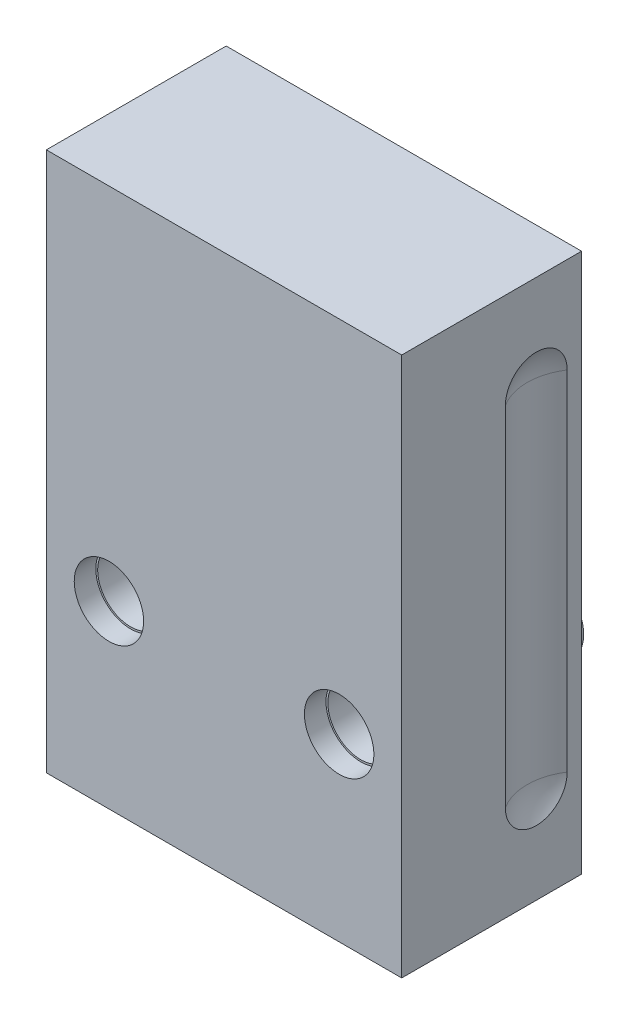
ISO-10303-21;
HEADER;
FILE_DESCRIPTION(('STEP AP214'),'2;1');
FILE_NAME('part.step','',(''),(''),'','','');
FILE_SCHEMA(('AUTOMOTIVE_DESIGN { 1 0 10303 214 1 1 1 1 }'));
ENDSEC;
DATA;
#1=APPLICATION_CONTEXT('core data for automotive mechanical design processes');
#2=APPLICATION_PROTOCOL_DEFINITION('international standard','automotive_design',2000,#1);
#3=PRODUCT_CONTEXT('',#1,'mechanical');
#4=PRODUCT('Part','Part','',(#3));
#5=PRODUCT_RELATED_PRODUCT_CATEGORY('part','',(#4));
#6=PRODUCT_DEFINITION_FORMATION('','',#4);
#7=PRODUCT_DEFINITION_CONTEXT('part definition',#1,'design');
#8=PRODUCT_DEFINITION('design','',#6,#7);
#9=PRODUCT_DEFINITION_SHAPE('','',#8);
#10=(LENGTH_UNIT() NAMED_UNIT(*) SI_UNIT(.MILLI.,.METRE.));
#11=(NAMED_UNIT(*) PLANE_ANGLE_UNIT() SI_UNIT($,.RADIAN.));
#12=(NAMED_UNIT(*) SI_UNIT($,.STERADIAN.) SOLID_ANGLE_UNIT());
#13=UNCERTAINTY_MEASURE_WITH_UNIT(LENGTH_MEASURE(1.E-05),#10,'distance_accuracy_value','');
#14=(GEOMETRIC_REPRESENTATION_CONTEXT(3) GLOBAL_UNCERTAINTY_ASSIGNED_CONTEXT((#13)) GLOBAL_UNIT_ASSIGNED_CONTEXT((#10,
#11,#12)) REPRESENTATION_CONTEXT('',''));
#15=CARTESIAN_POINT('',(0.,0.,0.));
#16=DIRECTION('',(0.,0.,1.));
#17=DIRECTION('',(1.,0.,0.));
#18=AXIS2_PLACEMENT_3D('',#15,#16,#17);
#19=CARTESIAN_POINT('',(32.0000005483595,-99.5693254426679,16.5000000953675));
#20=DIRECTION('',(4.38690173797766E-08,0.,1.));
#21=DIRECTION('',(1.,0.,-4.38690173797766E-08));
#22=AXIS2_PLACEMENT_3D('',#19,#20,#21);
#23=CYLINDRICAL_SURFACE('',#22,2.6);
#24=CARTESIAN_POINT('',(31.9999999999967,-99.5693254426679,3.9999998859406));
#25=DIRECTION('',(0.,0.,-1.));
#26=DIRECTION('',(-1.,0.,0.));
#27=AXIS2_PLACEMENT_3D('',#24,#25,#26);
#28=CIRCLE('',#27,2.6);
#29=CARTESIAN_POINT('',(29.3999999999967,-99.5693254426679,3.9999998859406));
#30=VERTEX_POINT('',#29);
#31=EDGE_CURVE('E142',#30,#30,#28,.T.);
#32=ORIENTED_EDGE('',*,*,#31,.T.);
#33=EDGE_LOOP('',(#32));
#34=FACE_BOUND('',#33,.T.);
#35=CARTESIAN_POINT('',(32.0000001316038,-99.5693254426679,7.00000030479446));
#36=DIRECTION('',(4.38690173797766E-08,0.,1.));
#37=DIRECTION('',(1.,0.,-4.38690173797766E-08));
#38=AXIS2_PLACEMENT_3D('',#35,#36,#37);
#39=CIRCLE('',#38,2.6);
#40=CARTESIAN_POINT('',(34.6000001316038,-99.5693254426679,7.00000019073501));
#41=VERTEX_POINT('',#40);
#42=EDGE_CURVE('E18',#41,#41,#39,.T.);
#43=ORIENTED_EDGE('',*,*,#42,.T.);
#44=EDGE_LOOP('',(#43));
#45=FACE_BOUND('',#44,.T.);
#46=ADVANCED_FACE('F14',(#34,#45),#23,.F.);
#47=CARTESIAN_POINT('',(5.48359695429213E-07,-99.5693254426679,16.5000000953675));
#48=DIRECTION('',(4.38690173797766E-08,0.,1.));
#49=DIRECTION('',(1.,0.,-4.38690173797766E-08));
#50=AXIS2_PLACEMENT_3D('',#47,#48,#49);
#51=CYLINDRICAL_SURFACE('',#50,2.6);
#52=CARTESIAN_POINT('',(1.31604029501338E-07,-99.5693254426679,7.00000007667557));
#53=DIRECTION('',(4.38690173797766E-08,0.,1.));
#54=DIRECTION('',(1.,0.,-4.38690173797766E-08));
#55=AXIS2_PLACEMENT_3D('',#52,#53,#54);
#56=CIRCLE('',#55,2.6);
#57=CARTESIAN_POINT('',(2.60000013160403,-99.5693254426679,6.99999996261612));
#58=VERTEX_POINT('',#57);
#59=EDGE_CURVE('E340',#58,#58,#56,.T.);
#60=ORIENTED_EDGE('',*,*,#59,.T.);
#61=EDGE_LOOP('',(#60));
#62=FACE_BOUND('',#61,.T.);
#63=CARTESIAN_POINT('',(-2.795985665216E-12,-99.5693254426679,3.9999998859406));
#64=DIRECTION('',(0.,0.,-1.));
#65=DIRECTION('',(-1.,0.,0.));
#66=AXIS2_PLACEMENT_3D('',#63,#64,#65);
#67=CIRCLE('',#66,2.6);
#68=CARTESIAN_POINT('',(-2.6000000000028,-99.5693254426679,3.9999998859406));
#69=VERTEX_POINT('',#68);
#70=EDGE_CURVE('E139',#69,#69,#67,.T.);
#71=ORIENTED_EDGE('',*,*,#70,.T.);
#72=EDGE_LOOP('',(#71));
#73=FACE_BOUND('',#72,.T.);
#74=ADVANCED_FACE('F617',(#62,#73),#51,.F.);
#75=CARTESIAN_POINT('',(31.9999999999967,-99.5693254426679,1.50000000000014));
#76=DIRECTION('',(0.,0.,-1.));
#77=DIRECTION('',(-1.,0.,0.));
#78=AXIS2_PLACEMENT_3D('',#75,#76,#77);
#79=CYLINDRICAL_SURFACE('',#78,2.6);
#80=ORIENTED_EDGE('',*,*,#31,.F.);
#81=EDGE_LOOP('',(#80));
#82=FACE_BOUND('',#81,.T.);
#83=CARTESIAN_POINT('',(31.9999999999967,-99.5693254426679,3.02058725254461E-13));
#84=DIRECTION('',(0.,0.,-1.));
#85=DIRECTION('',(-1.,0.,0.));
#86=AXIS2_PLACEMENT_3D('',#83,#84,#85);
#87=CIRCLE('',#86,2.6);
#88=CARTESIAN_POINT('',(29.3999999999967,-99.5693254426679,3.02058725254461E-13));
#89=VERTEX_POINT('',#88);
#90=EDGE_CURVE('E338',#89,#89,#87,.F.);
#91=ORIENTED_EDGE('',*,*,#90,.F.);
#92=EDGE_LOOP('',(#91));
#93=FACE_BOUND('',#92,.T.);
#94=ADVANCED_FACE('F362',(#82,#93),#79,.F.);
#95=CARTESIAN_POINT('',(-2.795985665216E-12,-99.5693254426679,-0.349982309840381));
#96=DIRECTION('',(0.,0.,-1.));
#97=DIRECTION('',(-1.,0.,0.));
#98=AXIS2_PLACEMENT_3D('',#95,#96,#97);
#99=CYLINDRICAL_SURFACE('',#98,2.6);
#100=ORIENTED_EDGE('',*,*,#70,.F.);
#101=EDGE_LOOP('',(#100));
#102=FACE_BOUND('',#101,.T.);
#103=CARTESIAN_POINT('',(-2.795985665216E-12,-99.5693254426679,3.02004515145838E-13));
#104=DIRECTION('',(0.,0.,-1.));
#105=DIRECTION('',(-1.,0.,0.));
#106=AXIS2_PLACEMENT_3D('',#103,#104,#105);
#107=CIRCLE('',#106,2.6);
#108=CARTESIAN_POINT('',(-2.6000000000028,-99.5693254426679,3.02004515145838E-13));
#109=VERTEX_POINT('',#108);
#110=EDGE_CURVE('E335',#109,#109,#107,.F.);
#111=ORIENTED_EDGE('',*,*,#110,.F.);
#112=EDGE_LOOP('',(#111));
#113=FACE_BOUND('',#112,.T.);
#114=ADVANCED_FACE('F351',(#102,#113),#99,.F.);
#115=CARTESIAN_POINT('',(32.0000010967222,-99.5693254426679,7.00000019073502));
#116=DIRECTION('',(0.,0.,-1.));
#117=DIRECTION('',(-1.,0.,0.));
#118=AXIS2_PLACEMENT_3D('',#115,#116,#117);
#119=PLANE('',#118);
#120=CARTESIAN_POINT('',(32.0000010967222,-99.5693254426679,7.00000019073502));
#121=DIRECTION('',(0.,0.,-1.));
#122=DIRECTION('',(-1.,0.,0.));
#123=AXIS2_PLACEMENT_3D('',#120,#121,#122);
#124=CIRCLE('',#123,4.57);
#125=CARTESIAN_POINT('',(27.4300010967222,-99.5693254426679,7.00000019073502));
#126=VERTEX_POINT('',#125);
#127=EDGE_CURVE('E332',#126,#126,#124,.F.);
#128=ORIENTED_EDGE('',*,*,#127,.T.);
#129=EDGE_LOOP('',(#128));
#130=FACE_BOUND('',#129,.T.);
#131=ORIENTED_EDGE('',*,*,#42,.F.);
#132=EDGE_LOOP('',(#131));
#133=FACE_BOUND('',#132,.T.);
#134=ADVANCED_FACE('F348',(#130,#133),#119,.F.);
#135=CARTESIAN_POINT('',(1.09672241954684E-06,-99.5693254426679,7.00000019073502));
#136=DIRECTION('',(0.,0.,-1.));
#137=DIRECTION('',(-1.,0.,0.));
#138=AXIS2_PLACEMENT_3D('',#135,#136,#137);
#139=PLANE('',#138);
#140=CARTESIAN_POINT('',(1.09672241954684E-06,-99.5693254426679,7.00000019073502));
#141=DIRECTION('',(0.,0.,-1.));
#142=DIRECTION('',(-1.,0.,0.));
#143=AXIS2_PLACEMENT_3D('',#140,#141,#142);
#144=CIRCLE('',#143,4.57);
#145=CARTESIAN_POINT('',(-4.56999890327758,-99.5693254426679,7.00000019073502));
#146=VERTEX_POINT('',#145);
#147=EDGE_CURVE('E329',#146,#146,#144,.F.);
#148=ORIENTED_EDGE('',*,*,#147,.T.);
#149=EDGE_LOOP('',(#148));
#150=FACE_BOUND('',#149,.T.);
#151=ORIENTED_EDGE('',*,*,#59,.F.);
#152=EDGE_LOOP('',(#151));
#153=FACE_BOUND('',#152,.T.);
#154=ADVANCED_FACE('F350',(#150,#153),#139,.F.);
#155=CARTESIAN_POINT('',(31.9999999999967,-99.5693254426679,3.01980662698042E-13));
#156=DIRECTION('',(0.,0.,-1.));
#157=DIRECTION('',(-1.,0.,0.));
#158=AXIS2_PLACEMENT_3D('',#155,#156,#157);
#159=PLANE('',#158);
#160=CARTESIAN_POINT('',(31.9999999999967,-99.5693254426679,3.01841884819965E-13));
#161=DIRECTION('',(0.,0.,-1.));
#162=DIRECTION('',(-1.,0.,0.));
#163=AXIS2_PLACEMENT_3D('',#160,#161,#162);
#164=CIRCLE('',#163,5.);
#165=CARTESIAN_POINT('',(26.9999999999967,-99.5693254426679,3.01841884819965E-13));
#166=VERTEX_POINT('',#165);
#167=EDGE_CURVE('E326',#166,#166,#164,.F.);
#168=ORIENTED_EDGE('',*,*,#167,.F.);
#169=EDGE_LOOP('',(#168));
#170=FACE_BOUND('',#169,.T.);
#171=ORIENTED_EDGE('',*,*,#90,.T.);
#172=EDGE_LOOP('',(#171));
#173=FACE_BOUND('',#172,.T.);
#174=ADVANCED_FACE('F359',(#170,#173),#159,.T.);
#175=CARTESIAN_POINT('',(-2.795985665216E-12,-99.5693254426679,3.01980662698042E-13));
#176=DIRECTION('',(0.,0.,-1.));
#177=DIRECTION('',(-1.,0.,0.));
#178=AXIS2_PLACEMENT_3D('',#175,#176,#177);
#179=PLANE('',#178);
#180=CARTESIAN_POINT('',(-2.795985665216E-12,-99.5693254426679,3.01841884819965E-13));
#181=DIRECTION('',(0.,0.,-1.));
#182=DIRECTION('',(-1.,0.,0.));
#183=AXIS2_PLACEMENT_3D('',#180,#181,#182);
#184=CIRCLE('',#183,5.);
#185=CARTESIAN_POINT('',(-5.0000000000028,-99.5693254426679,3.01841884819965E-13));
#186=VERTEX_POINT('',#185);
#187=EDGE_CURVE('E240',#186,#186,#184,.F.);
#188=ORIENTED_EDGE('',*,*,#187,.F.);
#189=EDGE_LOOP('',(#188));
#190=FACE_BOUND('',#189,.T.);
#191=ORIENTED_EDGE('',*,*,#110,.T.);
#192=EDGE_LOOP('',(#191));
#193=FACE_BOUND('',#192,.T.);
#194=ADVANCED_FACE('F369',(#190,#193),#179,.T.);
#195=CARTESIAN_POINT('',(15.9999999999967,-86.769325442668,13.));
#196=DIRECTION('',(0.,0.,1.));
#197=DIRECTION('',(1.,0.,0.));
#198=AXIS2_PLACEMENT_3D('',#195,#196,#197);
#199=PLANE('',#198);
#200=DIRECTION('',(1.,0.,0.));
#201=VECTOR('',#200,1.);
#202=CARTESIAN_POINT('',(15.9999999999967,-109.769325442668,13.));
#203=LINE('',#202,#201);
#204=CARTESIAN_POINT('',(5.99999999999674,-109.769325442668,13.));
#205=VERTEX_POINT('',#204);
#206=CARTESIAN_POINT('',(25.9999999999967,-109.769325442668,13.));
#207=VERTEX_POINT('',#206);
#208=EDGE_CURVE('E236',#205,#207,#203,.T.);
#209=ORIENTED_EDGE('',*,*,#208,.F.);
#210=DIRECTION('',(0.,1.,0.));
#211=VECTOR('',#210,1.);
#212=CARTESIAN_POINT('',(5.99999999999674,-86.769325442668,13.));
#213=LINE('',#212,#211);
#214=CARTESIAN_POINT('',(5.99999999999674,-63.769325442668,13.));
#215=VERTEX_POINT('',#214);
#216=EDGE_CURVE('E232',#215,#205,#213,.F.);
#217=ORIENTED_EDGE('',*,*,#216,.F.);
#218=DIRECTION('',(1.,0.,0.));
#219=VECTOR('',#218,1.);
#220=CARTESIAN_POINT('',(15.9999999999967,-63.769325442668,13.));
#221=LINE('',#220,#219);
#222=CARTESIAN_POINT('',(25.9999999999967,-63.769325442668,13.));
#223=VERTEX_POINT('',#222);
#224=EDGE_CURVE('E222',#223,#215,#221,.F.);
#225=ORIENTED_EDGE('',*,*,#224,.F.);
#226=DIRECTION('',(0.,1.,0.));
#227=VECTOR('',#226,1.);
#228=CARTESIAN_POINT('',(25.9999999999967,-86.769325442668,13.));
#229=LINE('',#228,#227);
#230=EDGE_CURVE('E245',#207,#223,#229,.T.);
#231=ORIENTED_EDGE('',*,*,#230,.F.);
#232=EDGE_LOOP('',(#209,#217,#225,#231));
#233=FACE_BOUND('',#232,.T.);
#234=ADVANCED_FACE('F235',(#233),#199,.F.);
#235=CARTESIAN_POINT('',(32.0000010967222,-99.5693254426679,18.000000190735));
#236=DIRECTION('',(0.,0.,-1.));
#237=DIRECTION('',(-1.,0.,0.));
#238=AXIS2_PLACEMENT_3D('',#235,#236,#237);
#239=CYLINDRICAL_SURFACE('',#238,4.57);
#240=ORIENTED_EDGE('',*,*,#127,.F.);
#241=EDGE_LOOP('',(#240));
#242=FACE_BOUND('',#241,.T.);
#243=CARTESIAN_POINT('',(32.0000010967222,-99.5693254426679,26.000000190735));
#244=DIRECTION('',(0.,0.,-1.));
#245=DIRECTION('',(-1.,0.,0.));
#246=AXIS2_PLACEMENT_3D('',#243,#244,#245);
#247=CIRCLE('',#246,4.57);
#248=CARTESIAN_POINT('',(27.4300010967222,-99.5693254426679,26.000000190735));
#249=VERTEX_POINT('',#248);
#250=EDGE_CURVE('E253',#249,#249,#247,.F.);
#251=ORIENTED_EDGE('',*,*,#250,.T.);
#252=EDGE_LOOP('',(#251));
#253=FACE_BOUND('',#252,.T.);
#254=ADVANCED_FACE('F376',(#242,#253),#239,.F.);
#255=CARTESIAN_POINT('',(1.09672241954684E-06,-99.5693254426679,18.000000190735));
#256=DIRECTION('',(0.,0.,-1.));
#257=DIRECTION('',(-1.,0.,0.));
#258=AXIS2_PLACEMENT_3D('',#255,#256,#257);
#259=CYLINDRICAL_SURFACE('',#258,4.57);
#260=ORIENTED_EDGE('',*,*,#147,.F.);
#261=EDGE_LOOP('',(#260));
#262=FACE_BOUND('',#261,.T.);
#263=CARTESIAN_POINT('',(1.09672241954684E-06,-99.5693254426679,26.000000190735));
#264=DIRECTION('',(0.,0.,-1.));
#265=DIRECTION('',(-1.,0.,0.));
#266=AXIS2_PLACEMENT_3D('',#263,#264,#265);
#267=CIRCLE('',#266,4.57);
#268=CARTESIAN_POINT('',(-4.56999890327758,-99.5693254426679,26.000000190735));
#269=VERTEX_POINT('',#268);
#270=EDGE_CURVE('E81',#269,#269,#267,.F.);
#271=ORIENTED_EDGE('',*,*,#270,.T.);
#272=EDGE_LOOP('',(#271));
#273=FACE_BOUND('',#272,.T.);
#274=ADVANCED_FACE('F379',(#262,#273),#259,.F.);
#275=CARTESIAN_POINT('',(31.9999999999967,-99.5693254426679,2.00000000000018));
#276=DIRECTION('',(0.,0.,-1.));
#277=DIRECTION('',(-1.,0.,0.));
#278=AXIS2_PLACEMENT_3D('',#275,#276,#277);
#279=CYLINDRICAL_SURFACE('',#278,5.);
#280=ORIENTED_EDGE('',*,*,#167,.T.);
#281=EDGE_LOOP('',(#280));
#282=FACE_BOUND('',#281,.T.);
#283=CARTESIAN_POINT('',(31.9999999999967,-99.5693254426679,4.00000000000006));
#284=DIRECTION('',(0.,0.,-1.));
#285=DIRECTION('',(-1.,0.,0.));
#286=AXIS2_PLACEMENT_3D('',#283,#284,#285);
#287=CIRCLE('',#286,5.);
#288=CARTESIAN_POINT('',(26.9999999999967,-99.5693254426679,4.00000000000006));
#289=VERTEX_POINT('',#288);
#290=EDGE_CURVE('E309',#289,#289,#287,.T.);
#291=ORIENTED_EDGE('',*,*,#290,.T.);
#292=EDGE_LOOP('',(#291));
#293=FACE_BOUND('',#292,.T.);
#294=ADVANCED_FACE('F383',(#282,#293),#279,.T.);
#295=CARTESIAN_POINT('',(-2.795985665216E-12,-99.5693254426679,2.00000000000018));
#296=DIRECTION('',(0.,0.,-1.));
#297=DIRECTION('',(-1.,0.,0.));
#298=AXIS2_PLACEMENT_3D('',#295,#296,#297);
#299=CYLINDRICAL_SURFACE('',#298,5.);
#300=ORIENTED_EDGE('',*,*,#187,.T.);
#301=EDGE_LOOP('',(#300));
#302=FACE_BOUND('',#301,.T.);
#303=CARTESIAN_POINT('',(-2.795985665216E-12,-99.5693254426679,4.00000000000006));
#304=DIRECTION('',(0.,0.,-1.));
#305=DIRECTION('',(-1.,0.,0.));
#306=AXIS2_PLACEMENT_3D('',#303,#304,#305);
#307=CIRCLE('',#306,5.);
#308=CARTESIAN_POINT('',(-5.0000000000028,-99.5693254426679,4.00000000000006));
#309=VERTEX_POINT('',#308);
#310=EDGE_CURVE('E306',#309,#309,#307,.T.);
#311=ORIENTED_EDGE('',*,*,#310,.T.);
#312=EDGE_LOOP('',(#311));
#313=FACE_BOUND('',#312,.T.);
#314=ADVANCED_FACE('F387',(#302,#313),#299,.T.);
#315=CARTESIAN_POINT('',(5.99999999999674,-86.769325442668,8.5));
#316=DIRECTION('',(1.,0.,0.));
#317=DIRECTION('',(0.,0.,-1.));
#318=AXIS2_PLACEMENT_3D('',#315,#316,#317);
#319=PLANE('',#318);
#320=DIRECTION('',(0.,0.,1.));
#321=VECTOR('',#320,1.);
#322=CARTESIAN_POINT('',(5.99999999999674,-109.769325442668,8.5));
#323=LINE('',#322,#321);
#324=CARTESIAN_POINT('',(5.99999999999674,-109.769325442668,4.00000000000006));
#325=VERTEX_POINT('',#324);
#326=EDGE_CURVE('E249',#325,#205,#323,.T.);
#327=ORIENTED_EDGE('',*,*,#326,.F.);
#328=DIRECTION('',(0.,1.,0.));
#329=VECTOR('',#328,1.);
#330=CARTESIAN_POINT('',(5.99999999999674,-87.069325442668,4.00000000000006));
#331=LINE('',#330,#329);
#332=CARTESIAN_POINT('',(5.99999999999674,-63.769325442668,4.00000000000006));
#333=VERTEX_POINT('',#332);
#334=EDGE_CURVE('E244',#325,#333,#331,.T.);
#335=ORIENTED_EDGE('',*,*,#334,.T.);
#336=DIRECTION('',(0.,0.,-1.));
#337=VECTOR('',#336,1.);
#338=CARTESIAN_POINT('',(5.99999999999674,-63.769325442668,8.5));
#339=LINE('',#338,#337);
#340=EDGE_CURVE('E227',#215,#333,#339,.T.);
#341=ORIENTED_EDGE('',*,*,#340,.F.);
#342=ORIENTED_EDGE('',*,*,#216,.T.);
#343=EDGE_LOOP('',(#327,#335,#341,#342));
#344=FACE_BOUND('',#343,.T.);
#345=ADVANCED_FACE('F243',(#344),#319,.T.);
#346=CARTESIAN_POINT('',(15.9999999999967,-63.769325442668,8.5));
#347=DIRECTION('',(0.,-1.,0.));
#348=DIRECTION('',(0.,0.,-1.));
#349=AXIS2_PLACEMENT_3D('',#346,#347,#348);
#350=PLANE('',#349);
#351=ORIENTED_EDGE('',*,*,#340,.T.);
#352=DIRECTION('',(1.,0.,0.));
#353=VECTOR('',#352,1.);
#354=CARTESIAN_POINT('',(15.9999989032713,-63.769325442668,4.00000000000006));
#355=LINE('',#354,#353);
#356=CARTESIAN_POINT('',(25.9999999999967,-63.769325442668,4.00000000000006));
#357=VERTEX_POINT('',#356);
#358=EDGE_CURVE('E421',#333,#357,#355,.T.);
#359=ORIENTED_EDGE('',*,*,#358,.T.);
#360=DIRECTION('',(0.,0.,1.));
#361=VECTOR('',#360,1.);
#362=CARTESIAN_POINT('',(25.9999999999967,-63.769325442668,8.5));
#363=LINE('',#362,#361);
#364=EDGE_CURVE('E229',#223,#357,#363,.F.);
#365=ORIENTED_EDGE('',*,*,#364,.F.);
#366=ORIENTED_EDGE('',*,*,#224,.T.);
#367=EDGE_LOOP('',(#351,#359,#365,#366));
#368=FACE_BOUND('',#367,.T.);
#369=ADVANCED_FACE('F224',(#368),#350,.T.);
#370=CARTESIAN_POINT('',(25.9999999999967,-86.769325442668,8.5));
#371=DIRECTION('',(-1.,0.,0.));
#372=DIRECTION('',(0.,0.,1.));
#373=AXIS2_PLACEMENT_3D('',#370,#371,#372);
#374=PLANE('',#373);
#375=ORIENTED_EDGE('',*,*,#364,.T.);
#376=DIRECTION('',(0.,1.,0.));
#377=VECTOR('',#376,1.);
#378=CARTESIAN_POINT('',(25.9999999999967,-87.069325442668,4.00000000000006));
#379=LINE('',#378,#377);
#380=CARTESIAN_POINT('',(25.9999999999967,-109.769325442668,4.00000000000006));
#381=VERTEX_POINT('',#380);
#382=EDGE_CURVE('E302',#357,#381,#379,.F.);
#383=ORIENTED_EDGE('',*,*,#382,.T.);
#384=DIRECTION('',(0.,0.,1.));
#385=VECTOR('',#384,1.);
#386=CARTESIAN_POINT('',(25.9999999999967,-109.769325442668,8.5));
#387=LINE('',#386,#385);
#388=EDGE_CURVE('E251',#207,#381,#387,.F.);
#389=ORIENTED_EDGE('',*,*,#388,.F.);
#390=ORIENTED_EDGE('',*,*,#230,.T.);
#391=EDGE_LOOP('',(#375,#383,#389,#390));
#392=FACE_BOUND('',#391,.T.);
#393=ADVANCED_FACE('F396',(#392),#374,.T.);
#394=CARTESIAN_POINT('',(15.9999999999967,-109.769325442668,8.5));
#395=DIRECTION('',(0.,1.,0.));
#396=DIRECTION('',(0.,0.,1.));
#397=AXIS2_PLACEMENT_3D('',#394,#395,#396);
#398=PLANE('',#397);
#399=ORIENTED_EDGE('',*,*,#388,.T.);
#400=DIRECTION('',(1.,0.,0.));
#401=VECTOR('',#400,1.);
#402=CARTESIAN_POINT('',(15.9999989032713,-109.769325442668,4.00000000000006));
#403=LINE('',#402,#401);
#404=EDGE_CURVE('E417',#381,#325,#403,.F.);
#405=ORIENTED_EDGE('',*,*,#404,.T.);
#406=ORIENTED_EDGE('',*,*,#326,.T.);
#407=ORIENTED_EDGE('',*,*,#208,.T.);
#408=EDGE_LOOP('',(#399,#405,#406,#407));
#409=FACE_BOUND('',#408,.T.);
#410=ADVANCED_FACE('F399',(#409),#398,.T.);
#411=CARTESIAN_POINT('',(32.0000010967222,-99.5693254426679,26.000000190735));
#412=DIRECTION('',(0.,0.,-1.));
#413=DIRECTION('',(-1.,0.,0.));
#414=AXIS2_PLACEMENT_3D('',#411,#412,#413);
#415=PLANE('',#414);
#416=CARTESIAN_POINT('',(32.0000010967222,-99.5693254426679,26.000000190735));
#417=DIRECTION('',(0.,0.,-1.));
#418=DIRECTION('',(-1.,0.,0.));
#419=AXIS2_PLACEMENT_3D('',#416,#417,#418);
#420=CIRCLE('',#419,4.825);
#421=CARTESIAN_POINT('',(27.1750010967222,-99.5693254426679,26.000000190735));
#422=VERTEX_POINT('',#421);
#423=EDGE_CURVE('E414',#422,#422,#420,.F.);
#424=ORIENTED_EDGE('',*,*,#423,.T.);
#425=EDGE_LOOP('',(#424));
#426=FACE_BOUND('',#425,.T.);
#427=ORIENTED_EDGE('',*,*,#250,.F.);
#428=EDGE_LOOP('',(#427));
#429=FACE_BOUND('',#428,.T.);
#430=ADVANCED_FACE('F402',(#426,#429),#415,.F.);
#431=CARTESIAN_POINT('',(1.09672241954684E-06,-99.5693254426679,26.000000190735));
#432=DIRECTION('',(0.,0.,-1.));
#433=DIRECTION('',(-1.,0.,0.));
#434=AXIS2_PLACEMENT_3D('',#431,#432,#433);
#435=PLANE('',#434);
#436=CARTESIAN_POINT('',(1.09672241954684E-06,-99.5693254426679,26.000000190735));
#437=DIRECTION('',(0.,0.,-1.));
#438=DIRECTION('',(-1.,0.,0.));
#439=AXIS2_PLACEMENT_3D('',#436,#437,#438);
#440=CIRCLE('',#439,4.825);
#441=CARTESIAN_POINT('',(-4.82499890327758,-99.5693254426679,26.000000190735));
#442=VERTEX_POINT('',#441);
#443=EDGE_CURVE('E96',#442,#442,#440,.F.);
#444=ORIENTED_EDGE('',*,*,#443,.T.);
#445=EDGE_LOOP('',(#444));
#446=FACE_BOUND('',#445,.T.);
#447=ORIENTED_EDGE('',*,*,#270,.F.);
#448=EDGE_LOOP('',(#447));
#449=FACE_BOUND('',#448,.T.);
#450=ADVANCED_FACE('F265',(#446,#449),#435,.F.);
#451=CARTESIAN_POINT('',(47.3299999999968,-111.273618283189,10.2957071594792));
#452=DIRECTION('',(0.581022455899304,0.682394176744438,0.4435663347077));
#453=DIRECTION('',(-0.709522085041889,0.691686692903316,-0.134714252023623));
#454=AXIS2_PLACEMENT_3D('',#451,#452,#453);
#455=SPHERICAL_SURFACE('',#454,7.9);
#456=CARTESIAN_POINT('',(47.3299999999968,-111.273618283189,10.2957071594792));
#457=DIRECTION('',(0.,1.,0.));
#458=DIRECTION('',(0.,0.,1.));
#459=AXIS2_PLACEMENT_3D('',#456,#457,#458);
#460=CIRCLE('',#459,7.9);
#461=CARTESIAN_POINT('',(40.6999999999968,-111.273618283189,6.00000000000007));
#462=VERTEX_POINT('',#461);
#463=CARTESIAN_POINT('',(40.6999999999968,-111.273618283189,14.5914143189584));
#464=VERTEX_POINT('',#463);
#465=EDGE_CURVE('E73',#462,#464,#460,.T.);
#466=ORIENTED_EDGE('',*,*,#465,.T.);
#467=CARTESIAN_POINT('',(40.6999999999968,-111.273618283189,14.5914143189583));
#468=CARTESIAN_POINT('',(40.6999999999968,-111.394436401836,14.5914273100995));
#469=CARTESIAN_POINT('',(40.6999999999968,-111.515252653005,14.5863177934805));
#470=CARTESIAN_POINT('',(40.6999999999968,-111.756020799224,14.5659475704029));
#471=CARTESIAN_POINT('',(40.6999999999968,-111.875972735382,14.5506873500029));
#472=CARTESIAN_POINT('',(40.6999999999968,-112.114079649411,14.5101237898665));
#473=CARTESIAN_POINT('',(40.6999999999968,-112.232235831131,14.4848275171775));
#474=CARTESIAN_POINT('',(40.6999999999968,-112.465996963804,14.4243758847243));
#475=CARTESIAN_POINT('',(40.6999999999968,-112.581601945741,14.3892206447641));
#476=CARTESIAN_POINT('',(40.6999999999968,-112.809473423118,14.3092881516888));
#477=CARTESIAN_POINT('',(40.6999999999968,-112.921738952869,14.264508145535));
#478=CARTESIAN_POINT('',(40.6999999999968,-113.142139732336,14.1656323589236));
#479=CARTESIAN_POINT('',(40.6999999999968,-113.250273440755,14.111533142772));
#480=CARTESIAN_POINT('',(40.6999999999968,-113.46153766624,13.9944482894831));
#481=CARTESIAN_POINT('',(40.6999999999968,-113.5646709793,13.9314676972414));
#482=CARTESIAN_POINT('',(40.6999999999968,-113.765304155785,13.7970196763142));
#483=CARTESIAN_POINT('',(40.6999999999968,-113.862801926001,13.7255491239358));
#484=CARTESIAN_POINT('',(40.6999999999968,-114.051396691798,13.5746742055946));
#485=CARTESIAN_POINT('',(40.6999999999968,-114.142495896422,13.4952726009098));
#486=CARTESIAN_POINT('',(40.6999999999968,-114.31771580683,13.3290483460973));
#487=CARTESIAN_POINT('',(40.6999999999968,-114.401833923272,13.2422229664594));
#488=CARTESIAN_POINT('',(40.6999999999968,-114.562438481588,13.0618134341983));
#489=CARTESIAN_POINT('',(40.6999999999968,-114.638926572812,12.9682307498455));
#490=CARTESIAN_POINT('',(40.6999999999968,-114.783774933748,12.7749193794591));
#491=CARTESIAN_POINT('',(40.6999999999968,-114.852132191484,12.6751884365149));
#492=CARTESIAN_POINT('',(40.6999999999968,-114.980173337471,12.4703635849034));
#493=CARTESIAN_POINT('',(40.6999999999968,-115.039860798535,12.3652719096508));
#494=CARTESIAN_POINT('',(40.6999999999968,-115.150192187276,12.1503948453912));
#495=CARTESIAN_POINT('',(40.6999999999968,-115.200832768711,12.0406077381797));
#496=CARTESIAN_POINT('',(40.6999999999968,-115.292663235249,11.8172053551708));
#497=CARTESIAN_POINT('',(40.6999999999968,-115.333857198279,11.703591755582));
#498=CARTESIAN_POINT('',(40.6999999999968,-115.406543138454,11.4732562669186));
#499=CARTESIAN_POINT('',(40.6999999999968,-115.438031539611,11.3565332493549));
#500=CARTESIAN_POINT('',(40.6999999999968,-115.491052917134,11.1208890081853));
#501=CARTESIAN_POINT('',(40.6999999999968,-115.512589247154,11.0019685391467));
#502=CARTESIAN_POINT('',(40.6999999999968,-115.545574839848,10.7626945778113));
#503=CARTESIAN_POINT('',(40.6999999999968,-115.55702059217,10.6423406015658));
#504=CARTESIAN_POINT('',(40.6999999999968,-115.569729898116,10.4011144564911));
#505=CARTESIAN_POINT('',(40.6999999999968,-115.570994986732,10.2802423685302));
#506=CARTESIAN_POINT('',(40.6999999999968,-115.563338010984,10.038821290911));
#507=CARTESIAN_POINT('',(40.6999999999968,-115.554415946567,9.91827230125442));
#508=CARTESIAN_POINT('',(40.6999999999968,-115.526445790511,9.67833477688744));
#509=CARTESIAN_POINT('',(40.6999999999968,-115.507396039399,9.55894643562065));
#510=CARTESIAN_POINT('',(40.6999999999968,-115.459313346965,9.32224057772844));
#511=CARTESIAN_POINT('',(40.6999999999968,-115.430283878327,9.20492235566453));
#512=CARTESIAN_POINT('',(40.6999999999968,-115.362434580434,8.97310671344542));
#513=CARTESIAN_POINT('',(40.6999999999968,-115.323611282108,8.85861030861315));
#514=CARTESIAN_POINT('',(40.6999999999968,-115.236471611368,8.63333732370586));
#515=CARTESIAN_POINT('',(40.6999999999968,-115.188158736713,8.52255939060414));
#516=CARTESIAN_POINT('',(40.6999999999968,-115.082353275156,8.30542346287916));
#517=CARTESIAN_POINT('',(40.6999999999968,-115.024857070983,8.19906723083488));
#518=CARTESIAN_POINT('',(40.6999999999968,-114.901130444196,7.99161596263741));
#519=CARTESIAN_POINT('',(40.6999999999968,-114.834903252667,7.89051899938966));
#520=CARTESIAN_POINT('',(40.6999999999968,-114.694146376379,7.69423112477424));
#521=CARTESIAN_POINT('',(40.6999999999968,-114.619614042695,7.59904211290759));
#522=CARTESIAN_POINT('',(40.6999999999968,-114.462823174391,7.41531631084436));
#523=CARTESIAN_POINT('',(40.6999999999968,-114.380567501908,7.32677707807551));
#524=CARTESIAN_POINT('',(40.6999999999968,-114.208871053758,7.15692120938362));
#525=CARTESIAN_POINT('',(40.6999999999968,-114.119428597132,7.07560627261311));
#526=CARTESIAN_POINT('',(40.6999999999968,-113.934045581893,6.92082909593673));
#527=CARTESIAN_POINT('',(40.6999999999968,-113.838107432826,6.84736396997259));
#528=CARTESIAN_POINT('',(40.6999999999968,-113.640317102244,6.70872624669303));
#529=CARTESIAN_POINT('',(40.6999999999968,-113.538460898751,6.64355938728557));
#530=CARTESIAN_POINT('',(40.6999999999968,-113.329657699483,6.52206349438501));
#531=CARTESIAN_POINT('',(40.6999999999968,-113.222712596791,6.46573120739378));
#532=CARTESIAN_POINT('',(40.6999999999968,-113.004350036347,6.36222511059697));
#533=CARTESIAN_POINT('',(40.6999999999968,-112.892928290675,6.31506034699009));
#534=CARTESIAN_POINT('',(40.6999999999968,-112.666546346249,6.23031011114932));
#535=CARTESIAN_POINT('',(40.6999999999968,-112.551587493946,6.19272104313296));
#536=CARTESIAN_POINT('',(40.6999999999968,-112.319041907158,6.1274028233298));
#537=CARTESIAN_POINT('',(40.6999999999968,-112.201458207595,6.0996628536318));
#538=CARTESIAN_POINT('',(40.6999999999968,-111.964419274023,6.05419248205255));
#539=CARTESIAN_POINT('',(40.6999999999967,-111.844964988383,6.03645716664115));
#540=CARTESIAN_POINT('',(40.6999999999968,-111.64997865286,6.01585355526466));
#541=CARTESIAN_POINT('',(40.6999999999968,-111.574758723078,6.00990468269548));
#542=CARTESIAN_POINT('',(40.6999999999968,-111.424234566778,6.00198075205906));
#543=CARTESIAN_POINT('',(40.6999999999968,-111.348930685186,5.99999914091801));
#544=CARTESIAN_POINT('',(40.6999999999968,-111.273618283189,6.));
#545=B_SPLINE_CURVE_WITH_KNOTS('',3,(#467,#468,#469,#470,#471,#472,#473,#474,#475,#476,#477,
#478,#479,#480,#481,#482,#483,#484,#485,#486,#487,#488,#489,#490,#491,#492,#493,#494,#495,#496,
#497,#498,#499,#500,#501,#502,#503,#504,#505,#506,#507,#508,#509,#510,#511,#512,#513,#514,#515,
#516,#517,#518,#519,#520,#521,#522,#523,#524,#525,#526,#527,#528,#529,#530,#531,#532,#533,#534,
#535,#536,#537,#538,#539,#540,#541,#542,#543,#544),.UNSPECIFIED.,.F.,.F.,(4,2,2,2,2,2,2,2,2,2,2,
2,2,2,2,2,2,2,2,2,2,2,2,2,2,2,2,2,2,2,2,2,2,2,2,2,2,2,4),(0.,0.362343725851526,
0.724670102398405,1.08674179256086,1.44880908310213,1.81098007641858,2.17328487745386,
2.5353847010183,2.89761816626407,3.25972595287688,3.62196745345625,3.98413047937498,
4.34642724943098,4.70857429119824,5.07085500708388,5.43297903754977,5.7952363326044,
6.15737146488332,6.51963252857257,6.88183897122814,7.24404541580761,7.60631122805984,
7.96845110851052,8.33071944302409,8.69285449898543,9.05513255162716,9.41727691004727,
9.77953710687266,10.1416635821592,10.5038750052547,10.8659527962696,11.2282796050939,
11.5904726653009,11.9530213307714,12.3154336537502,12.6774466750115,13.0392817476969,
13.2655500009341,13.4914441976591),.UNSPECIFIED.);
#546=EDGE_CURVE('E79',#464,#462,#545,.T.);
#547=ORIENTED_EDGE('',*,*,#546,.T.);
#548=EDGE_LOOP('',(#466,#547));
#549=FACE_BOUND('',#548,.T.);
#550=ADVANCED_FACE('F78',(#549),#455,.F.);
#551=CARTESIAN_POINT('',(47.3299999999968,-83.0646674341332,10.2957071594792));
#552=DIRECTION('',(0.,1.,0.));
#553=DIRECTION('',(0.,0.,1.));
#554=AXIS2_PLACEMENT_3D('',#551,#552,#553);
#555=CYLINDRICAL_SURFACE('',#554,7.9);
#556=CARTESIAN_POINT('',(47.3299999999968,-62.8650326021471,10.2957071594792));
#557=DIRECTION('',(0.,1.,0.));
#558=DIRECTION('',(0.,0.,1.));
#559=AXIS2_PLACEMENT_3D('',#556,#557,#558);
#560=CIRCLE('',#559,7.9);
#561=CARTESIAN_POINT('',(40.6999999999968,-62.8650326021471,6.00000000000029));
#562=VERTEX_POINT('',#561);
#563=CARTESIAN_POINT('',(40.6999999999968,-62.8650326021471,14.5914143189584));
#564=VERTEX_POINT('',#563);
#565=EDGE_CURVE('E80',#562,#564,#560,.T.);
#566=ORIENTED_EDGE('',*,*,#565,.T.);
#567=DIRECTION('',(0.,-1.,0.));
#568=VECTOR('',#567,1.);
#569=CARTESIAN_POINT('',(40.6999999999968,-87.069325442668,14.5914143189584));
#570=LINE('',#569,#568);
#571=EDGE_CURVE('E87',#564,#464,#570,.T.);
#572=ORIENTED_EDGE('',*,*,#571,.T.);
#573=ORIENTED_EDGE('',*,*,#465,.F.);
#574=DIRECTION('',(0.,-1.,0.));
#575=VECTOR('',#574,1.);
#576=CARTESIAN_POINT('',(40.6999999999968,-87.069325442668,6.));
#577=LINE('',#576,#575);
#578=EDGE_CURVE('E89',#462,#562,#577,.F.);
#579=ORIENTED_EDGE('',*,*,#578,.T.);
#580=EDGE_LOOP('',(#566,#572,#573,#579));
#581=FACE_BOUND('',#580,.T.);
#582=ADVANCED_FACE('F91',(#581),#555,.F.);
#583=CARTESIAN_POINT('',(47.329999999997,-62.8650326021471,10.2957071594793));
#584=DIRECTION('',(0.581022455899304,0.682394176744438,0.4435663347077));
#585=DIRECTION('',(-0.709522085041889,0.691686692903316,-0.134714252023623));
#586=AXIS2_PLACEMENT_3D('',#583,#584,#585);
#587=SPHERICAL_SURFACE('',#586,7.9);
#588=ORIENTED_EDGE('',*,*,#565,.F.);
#589=CARTESIAN_POINT('',(40.6999999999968,-62.8650326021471,6.00000000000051));
#590=CARTESIAN_POINT('',(40.6999999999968,-62.7442144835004,5.99998700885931));
#591=CARTESIAN_POINT('',(40.6999999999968,-62.6233982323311,6.00509652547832));
#592=CARTESIAN_POINT('',(40.6999999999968,-62.3826300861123,6.02546674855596));
#593=CARTESIAN_POINT('',(40.6999999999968,-62.2626781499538,6.04072696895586));
#594=CARTESIAN_POINT('',(40.6999999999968,-62.0245712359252,6.08129052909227));
#595=CARTESIAN_POINT('',(40.6999999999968,-61.9064150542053,6.10658680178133));
#596=CARTESIAN_POINT('',(40.6999999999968,-61.6726539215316,6.16703843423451));
#597=CARTESIAN_POINT('',(40.6999999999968,-61.5570489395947,6.20219367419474));
#598=CARTESIAN_POINT('',(40.6999999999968,-61.3291774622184,6.28212616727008));
#599=CARTESIAN_POINT('',(40.6999999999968,-61.2169119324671,6.32690617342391));
#600=CARTESIAN_POINT('',(40.6999999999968,-60.9965111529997,6.42578196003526));
#601=CARTESIAN_POINT('',(40.6999999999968,-60.8883774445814,6.47988117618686));
#602=CARTESIAN_POINT('',(40.6999999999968,-60.6771132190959,6.59696602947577));
#603=CARTESIAN_POINT('',(40.6999999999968,-60.5739799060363,6.65994662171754));
#604=CARTESIAN_POINT('',(40.6999999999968,-60.3733467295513,6.79439464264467));
#605=CARTESIAN_POINT('',(40.6999999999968,-60.2758489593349,6.86586519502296));
#606=CARTESIAN_POINT('',(40.6999999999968,-60.0872541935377,7.01674011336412));
#607=CARTESIAN_POINT('',(40.6999999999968,-59.9961549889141,7.09614171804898));
#608=CARTESIAN_POINT('',(40.6999999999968,-59.8209350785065,7.26236597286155));
#609=CARTESIAN_POINT('',(40.6999999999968,-59.7368169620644,7.34919135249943));
#610=CARTESIAN_POINT('',(40.6999999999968,-59.5762124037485,7.52960088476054));
#611=CARTESIAN_POINT('',(40.6999999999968,-59.4997243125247,7.62318356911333));
#612=CARTESIAN_POINT('',(40.6999999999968,-59.3548759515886,7.81649493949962));
#613=CARTESIAN_POINT('',(40.6999999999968,-59.2865186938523,7.91622588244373));
#614=CARTESIAN_POINT('',(40.6999999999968,-59.1584775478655,8.12105073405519));
#615=CARTESIAN_POINT('',(40.6999999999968,-59.0987900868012,8.22614240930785));
#616=CARTESIAN_POINT('',(40.6999999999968,-58.9884586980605,8.44101947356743));
#617=CARTESIAN_POINT('',(40.6999999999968,-58.9378181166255,8.55080658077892));
#618=CARTESIAN_POINT('',(40.6999999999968,-58.8459876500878,8.77420896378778));
#619=CARTESIAN_POINT('',(40.6999999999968,-58.8047936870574,8.8878225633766));
#620=CARTESIAN_POINT('',(40.6999999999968,-58.7321077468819,9.11815805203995));
#621=CARTESIAN_POINT('',(40.6999999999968,-58.7006193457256,9.23488106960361));
#622=CARTESIAN_POINT('',(40.6999999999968,-58.647597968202,9.47052531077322));
#623=CARTESIAN_POINT('',(40.6999999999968,-58.6260616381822,9.58944577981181));
#624=CARTESIAN_POINT('',(40.6999999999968,-58.5930760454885,9.82871974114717));
#625=CARTESIAN_POINT('',(40.6999999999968,-58.5816302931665,9.94907371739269));
#626=CARTESIAN_POINT('',(40.6999999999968,-58.5689209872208,10.1902998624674));
#627=CARTESIAN_POINT('',(40.6999999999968,-58.5676558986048,10.3111719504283));
#628=CARTESIAN_POINT('',(40.6999999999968,-58.5753128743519,10.5525930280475));
#629=CARTESIAN_POINT('',(40.6999999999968,-58.584234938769,10.673142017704));
#630=CARTESIAN_POINT('',(40.6999999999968,-58.6122050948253,10.9130795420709));
#631=CARTESIAN_POINT('',(40.6999999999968,-58.6312548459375,11.0324678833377));
#632=CARTESIAN_POINT('',(40.6999999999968,-58.6793375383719,11.2691737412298));
#633=CARTESIAN_POINT('',(40.6999999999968,-58.7083670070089,11.3864919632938));
#634=CARTESIAN_POINT('',(40.6999999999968,-58.7762163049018,11.6183076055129));
#635=CARTESIAN_POINT('',(40.6999999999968,-58.8150396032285,11.7328040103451));
#636=CARTESIAN_POINT('',(40.6999999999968,-58.9021792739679,11.9580769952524));
#637=CARTESIAN_POINT('',(40.6999999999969,-58.950492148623,12.0688549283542));
#638=CARTESIAN_POINT('',(40.6999999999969,-59.0562976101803,12.2859908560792));
#639=CARTESIAN_POINT('',(40.6999999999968,-59.1137938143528,12.3923470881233));
#640=CARTESIAN_POINT('',(40.6999999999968,-59.23752044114,12.5997983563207));
#641=CARTESIAN_POINT('',(40.6999999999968,-59.3037476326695,12.7008953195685));
#642=CARTESIAN_POINT('',(40.6999999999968,-59.4445045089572,12.8971831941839));
#643=CARTESIAN_POINT('',(40.6999999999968,-59.5190368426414,12.9923722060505));
#644=CARTESIAN_POINT('',(40.6999999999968,-59.6758277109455,13.1760980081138));
#645=CARTESIAN_POINT('',(40.6999999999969,-59.7580833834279,13.2646372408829));
#646=CARTESIAN_POINT('',(40.6999999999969,-59.929779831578,13.4344931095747));
#647=CARTESIAN_POINT('',(40.6999999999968,-60.0192222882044,13.515808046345));
#648=CARTESIAN_POINT('',(40.6999999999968,-60.2046053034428,13.6705852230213));
#649=CARTESIAN_POINT('',(40.6999999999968,-60.3005434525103,13.7440503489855));
#650=CARTESIAN_POINT('',(40.6999999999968,-60.4983337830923,13.8826880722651));
#651=CARTESIAN_POINT('',(40.6999999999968,-60.6001899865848,13.9478549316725));
#652=CARTESIAN_POINT('',(40.6999999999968,-60.8089931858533,14.0693508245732));
#653=CARTESIAN_POINT('',(40.6999999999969,-60.9159382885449,14.1256831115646));
#654=CARTESIAN_POINT('',(40.6999999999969,-61.1343008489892,14.2291892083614));
#655=CARTESIAN_POINT('',(40.6999999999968,-61.2457225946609,14.2763539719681));
#656=CARTESIAN_POINT('',(40.6999999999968,-61.4721045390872,14.3611042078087));
#657=CARTESIAN_POINT('',(40.6999999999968,-61.5870633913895,14.3986932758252));
#658=CARTESIAN_POINT('',(40.6999999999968,-61.8196089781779,14.4640114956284));
#659=CARTESIAN_POINT('',(40.6999999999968,-61.937192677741,14.4917514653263));
#660=CARTESIAN_POINT('',(40.6999999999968,-62.1742316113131,14.5372218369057));
#661=CARTESIAN_POINT('',(40.6999999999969,-62.2936858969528,14.5549571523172));
#662=CARTESIAN_POINT('',(40.6999999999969,-62.4886722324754,14.5755607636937));
#663=CARTESIAN_POINT('',(40.6999999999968,-62.5638921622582,14.5815096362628));
#664=CARTESIAN_POINT('',(40.6999999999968,-62.7144163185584,14.5894335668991));
#665=CARTESIAN_POINT('',(40.6999999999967,-62.7897202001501,14.5914151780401));
#666=CARTESIAN_POINT('',(40.6999999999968,-62.8650326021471,14.5914143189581));
#667=B_SPLINE_CURVE_WITH_KNOTS('',3,(#589,#590,#591,#592,#593,#594,#595,#596,#597,#598,#599,
#600,#601,#602,#603,#604,#605,#606,#607,#608,#609,#610,#611,#612,#613,#614,#615,#616,#617,#618,
#619,#620,#621,#622,#623,#624,#625,#626,#627,#628,#629,#630,#631,#632,#633,#634,#635,#636,#637,
#638,#639,#640,#641,#642,#643,#644,#645,#646,#647,#648,#649,#650,#651,#652,#653,#654,#655,#656,
#657,#658,#659,#660,#661,#662,#663,#664,#665,#666),.UNSPECIFIED.,.F.,.F.,(4,2,2,2,2,2,2,2,2,2,2,
2,2,2,2,2,2,2,2,2,2,2,2,2,2,2,2,2,2,2,2,2,2,2,2,2,2,2,4),(0.,0.36234372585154,0.72467010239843,
1.08674179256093,1.44880908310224,1.81098007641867,2.17328487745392,2.53538470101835,
2.89761816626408,3.25972595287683,3.62196745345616,3.98413047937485,4.34642724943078,
4.70857429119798,5.07085500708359,5.43297903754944,5.79523633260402,6.1573714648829,
6.51963252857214,6.88183897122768,7.24404541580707,7.60631122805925,7.9684511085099,
8.33071944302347,8.69285449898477,9.05513255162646,9.41727691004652,9.77953710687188,
10.1416635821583,10.5038750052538,10.8659527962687,11.228279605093,11.5904726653,
11.9530213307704,12.3154336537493,12.6774466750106,13.039281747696,13.2655500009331,
13.4914441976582),.UNSPECIFIED.);
#668=EDGE_CURVE('E108',#562,#564,#667,.T.);
#669=ORIENTED_EDGE('',*,*,#668,.T.);
#670=EDGE_LOOP('',(#588,#669));
#671=FACE_BOUND('',#670,.T.);
#672=ADVANCED_FACE('F430',(#671),#587,.F.);
#673=CARTESIAN_POINT('',(-15.3300000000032,-111.273618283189,10.2957071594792));
#674=DIRECTION('',(0.581022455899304,0.682394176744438,0.4435663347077));
#675=DIRECTION('',(-0.709522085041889,0.691686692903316,-0.134714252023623));
#676=AXIS2_PLACEMENT_3D('',#673,#674,#675);
#677=SPHERICAL_SURFACE('',#676,7.9);
#678=CARTESIAN_POINT('',(-15.3300000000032,-111.273618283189,10.2957071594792));
#679=DIRECTION('',(0.,-1.,0.));
#680=DIRECTION('',(0.,0.,-1.));
#681=AXIS2_PLACEMENT_3D('',#678,#679,#680);
#682=CIRCLE('',#681,7.9);
#683=CARTESIAN_POINT('',(-8.70000000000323,-111.273618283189,14.5914143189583));
#684=VERTEX_POINT('',#683);
#685=CARTESIAN_POINT('',(-8.70000000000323,-111.273618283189,6.00000000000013));
#686=VERTEX_POINT('',#685);
#687=EDGE_CURVE('E315',#684,#686,#682,.F.);
#688=ORIENTED_EDGE('',*,*,#687,.T.);
#689=CARTESIAN_POINT('',(-8.70000000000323,-111.273618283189,6.));
#690=CARTESIAN_POINT('',(-8.70000000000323,-111.394436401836,5.99998700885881));
#691=CARTESIAN_POINT('',(-8.70000000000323,-111.515252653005,6.00509652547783));
#692=CARTESIAN_POINT('',(-8.70000000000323,-111.756020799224,6.02546674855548));
#693=CARTESIAN_POINT('',(-8.70000000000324,-111.875972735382,6.04072696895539));
#694=CARTESIAN_POINT('',(-8.70000000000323,-112.114079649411,6.08129052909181));
#695=CARTESIAN_POINT('',(-8.70000000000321,-112.232235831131,6.10658680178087));
#696=CARTESIAN_POINT('',(-8.70000000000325,-112.465996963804,6.16703843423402));
#697=CARTESIAN_POINT('',(-8.7000000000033,-112.581601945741,6.20219367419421));
#698=CARTESIAN_POINT('',(-8.7000000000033,-112.809473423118,6.28212616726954));
#699=CARTESIAN_POINT('',(-8.70000000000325,-112.921738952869,6.3269061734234));
#700=CARTESIAN_POINT('',(-8.70000000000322,-113.142139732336,6.42578196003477));
#701=CARTESIAN_POINT('',(-8.70000000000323,-113.250273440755,6.47988117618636));
#702=CARTESIAN_POINT('',(-8.70000000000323,-113.46153766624,6.59696602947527));
#703=CARTESIAN_POINT('',(-8.7000000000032,-113.5646709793,6.65994662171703));
#704=CARTESIAN_POINT('',(-8.70000000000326,-113.765304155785,6.79439464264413));
#705=CARTESIAN_POINT('',(-8.70000000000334,-113.862801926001,6.86586519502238));
#706=CARTESIAN_POINT('',(-8.70000000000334,-114.051396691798,7.01674011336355));
#707=CARTESIAN_POINT('',(-8.70000000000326,-114.142495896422,7.09614171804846));
#708=CARTESIAN_POINT('',(-8.70000000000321,-114.31771580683,7.26236597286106));
#709=CARTESIAN_POINT('',(-8.70000000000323,-114.401833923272,7.34919135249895));
#710=CARTESIAN_POINT('',(-8.70000000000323,-114.562438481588,7.52960088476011));
#711=CARTESIAN_POINT('',(-8.7000000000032,-114.638926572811,7.62318356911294));
#712=CARTESIAN_POINT('',(-8.70000000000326,-114.783774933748,7.81649493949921));
#713=CARTESIAN_POINT('',(-8.70000000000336,-114.852132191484,7.91622588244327));
#714=CARTESIAN_POINT('',(-8.70000000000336,-114.980173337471,8.12105073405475));
#715=CARTESIAN_POINT('',(-8.70000000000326,-115.039860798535,8.22614240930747));
#716=CARTESIAN_POINT('',(-8.7000000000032,-115.150192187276,8.4410194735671));
#717=CARTESIAN_POINT('',(-8.70000000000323,-115.200832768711,8.55080658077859));
#718=CARTESIAN_POINT('',(-8.70000000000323,-115.292663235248,8.77420896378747));
#719=CARTESIAN_POINT('',(-8.70000000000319,-115.333857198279,8.88782256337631));
#720=CARTESIAN_POINT('',(-8.70000000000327,-115.406543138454,9.11815805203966));
#721=CARTESIAN_POINT('',(-8.70000000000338,-115.438031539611,9.23488106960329));
#722=CARTESIAN_POINT('',(-8.70000000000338,-115.491052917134,9.47052531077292));
#723=CARTESIAN_POINT('',(-8.70000000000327,-115.512589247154,9.58944577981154));
#724=CARTESIAN_POINT('',(-8.70000000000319,-115.545574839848,9.82871974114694));
#725=CARTESIAN_POINT('',(-8.70000000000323,-115.55702059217,9.94907371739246));
#726=CARTESIAN_POINT('',(-8.70000000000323,-115.569729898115,10.1902998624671));
#727=CARTESIAN_POINT('',(-8.7000000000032,-115.570994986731,10.3111719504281));
#728=CARTESIAN_POINT('',(-8.70000000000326,-115.563338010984,10.5525930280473));
#729=CARTESIAN_POINT('',(-8.70000000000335,-115.554415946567,10.6731420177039));
#730=CARTESIAN_POINT('',(-8.70000000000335,-115.526445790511,10.9130795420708));
#731=CARTESIAN_POINT('',(-8.70000000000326,-115.507396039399,11.0324678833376));
#732=CARTESIAN_POINT('',(-8.7000000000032,-115.459313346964,11.2691737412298));
#733=CARTESIAN_POINT('',(-8.70000000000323,-115.430283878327,11.3864919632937));
#734=CARTESIAN_POINT('',(-8.70000000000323,-115.362434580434,11.6183076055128));
#735=CARTESIAN_POINT('',(-8.70000000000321,-115.323611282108,11.7328040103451));
#736=CARTESIAN_POINT('',(-8.70000000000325,-115.236471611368,11.9580769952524));
#737=CARTESIAN_POINT('',(-8.70000000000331,-115.188158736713,12.0688549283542));
#738=CARTESIAN_POINT('',(-8.70000000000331,-115.082353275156,12.2859908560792));
#739=CARTESIAN_POINT('',(-8.70000000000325,-115.024857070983,12.3923470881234));
#740=CARTESIAN_POINT('',(-8.70000000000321,-114.901130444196,12.5997983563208));
#741=CARTESIAN_POINT('',(-8.70000000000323,-114.834903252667,12.7008953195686));
#742=CARTESIAN_POINT('',(-8.70000000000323,-114.694146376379,12.897183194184));
#743=CARTESIAN_POINT('',(-8.70000000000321,-114.619614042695,12.9923722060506));
#744=CARTESIAN_POINT('',(-8.70000000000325,-114.462823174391,13.176098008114));
#745=CARTESIAN_POINT('',(-8.7000000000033,-114.380567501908,13.2646372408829));
#746=CARTESIAN_POINT('',(-8.7000000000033,-114.208871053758,13.4344931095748));
#747=CARTESIAN_POINT('',(-8.70000000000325,-114.119428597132,13.5158080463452));
#748=CARTESIAN_POINT('',(-8.70000000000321,-113.934045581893,13.6705852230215));
#749=CARTESIAN_POINT('',(-8.70000000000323,-113.838107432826,13.7440503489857));
#750=CARTESIAN_POINT('',(-8.70000000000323,-113.640317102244,13.8826880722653));
#751=CARTESIAN_POINT('',(-8.70000000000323,-113.538460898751,13.9478549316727));
#752=CARTESIAN_POINT('',(-8.70000000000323,-113.329657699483,14.0693508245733));
#753=CARTESIAN_POINT('',(-8.70000000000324,-113.222712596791,14.1256831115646));
#754=CARTESIAN_POINT('',(-8.70000000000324,-113.004350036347,14.2291892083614));
#755=CARTESIAN_POINT('',(-8.70000000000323,-112.892928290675,14.2763539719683));
#756=CARTESIAN_POINT('',(-8.70000000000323,-112.666546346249,14.3611042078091));
#757=CARTESIAN_POINT('',(-8.70000000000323,-112.551587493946,14.3986932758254));
#758=CARTESIAN_POINT('',(-8.70000000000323,-112.319041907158,14.4640114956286));
#759=CARTESIAN_POINT('',(-8.70000000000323,-112.201458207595,14.4917514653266));
#760=CARTESIAN_POINT('',(-8.70000000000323,-111.964419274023,14.5372218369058));
#761=CARTESIAN_POINT('',(-8.70000000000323,-111.844964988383,14.5549571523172));
#762=CARTESIAN_POINT('',(-8.70000000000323,-111.64997865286,14.5755607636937));
#763=CARTESIAN_POINT('',(-8.70000000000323,-111.574758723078,14.5815096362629));
#764=CARTESIAN_POINT('',(-8.70000000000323,-111.424234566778,14.5894335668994));
#765=CARTESIAN_POINT('',(-8.70000000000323,-111.348930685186,14.5914151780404));
#766=CARTESIAN_POINT('',(-8.70000000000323,-111.273618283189,14.5914143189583));
#767=B_SPLINE_CURVE_WITH_KNOTS('',3,(#689,#690,#691,#692,#693,#694,#695,#696,#697,#698,#699,
#700,#701,#702,#703,#704,#705,#706,#707,#708,#709,#710,#711,#712,#713,#714,#715,#716,#717,#718,
#719,#720,#721,#722,#723,#724,#725,#726,#727,#728,#729,#730,#731,#732,#733,#734,#735,#736,#737,
#738,#739,#740,#741,#742,#743,#744,#745,#746,#747,#748,#749,#750,#751,#752,#753,#754,#755,#756,
#757,#758,#759,#760,#761,#762,#763,#764,#765,#766),.UNSPECIFIED.,.F.,.F.,(4,2,2,2,2,2,2,2,2,2,2,
2,2,2,2,2,2,2,2,2,2,2,2,2,2,2,2,2,2,2,2,2,2,2,2,2,2,2,4),(0.,0.362343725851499,
0.724670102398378,1.08674179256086,1.44880908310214,1.81098007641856,2.17328487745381,
2.53538470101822,2.89761816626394,3.25972595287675,3.62196745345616,3.98413047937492,
4.34642724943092,4.70857429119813,5.0708550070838,5.43297903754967,5.79523633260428,
6.15737146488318,6.51963252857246,6.88183897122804,7.24404541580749,7.60631122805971,
7.96845110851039,8.33071944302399,8.69285449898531,9.05513255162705,9.41727691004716,
9.77953710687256,10.141663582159,10.5038750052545,10.8659527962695,11.2282796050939,
11.5904726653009,11.9530213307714,12.3154336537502,12.6774466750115,13.0392817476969,
13.265550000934,13.4914441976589),.UNSPECIFIED.);
#768=EDGE_CURVE('E113',#686,#684,#767,.T.);
#769=ORIENTED_EDGE('',*,*,#768,.T.);
#770=EDGE_LOOP('',(#688,#769));
#771=FACE_BOUND('',#770,.T.);
#772=ADVANCED_FACE('F427',(#771),#677,.F.);
#773=CARTESIAN_POINT('',(-15.3300000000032,-83.0646674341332,10.2957071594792));
#774=DIRECTION('',(0.,-1.,0.));
#775=DIRECTION('',(0.,0.,-1.));
#776=AXIS2_PLACEMENT_3D('',#773,#774,#775);
#777=CYLINDRICAL_SURFACE('',#776,7.9);
#778=ORIENTED_EDGE('',*,*,#687,.F.);
#779=DIRECTION('',(0.,1.,0.));
#780=VECTOR('',#779,1.);
#781=CARTESIAN_POINT('',(-8.70000000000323,-87.069325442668,14.5914143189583));
#782=LINE('',#781,#780);
#783=CARTESIAN_POINT('',(-8.70000000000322,-62.8650326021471,14.5914143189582));
#784=VERTEX_POINT('',#783);
#785=EDGE_CURVE('E109',#684,#784,#782,.T.);
#786=ORIENTED_EDGE('',*,*,#785,.T.);
#787=CARTESIAN_POINT('',(-15.3300000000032,-62.8650326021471,10.2957071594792));
#788=DIRECTION('',(0.,-1.,0.));
#789=DIRECTION('',(0.,0.,-1.));
#790=AXIS2_PLACEMENT_3D('',#787,#788,#789);
#791=CIRCLE('',#790,7.9);
#792=CARTESIAN_POINT('',(-8.70000000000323,-62.8650326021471,6.00000000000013));
#793=VERTEX_POINT('',#792);
#794=EDGE_CURVE('E311',#784,#793,#791,.F.);
#795=ORIENTED_EDGE('',*,*,#794,.T.);
#796=DIRECTION('',(0.,1.,0.));
#797=VECTOR('',#796,1.);
#798=CARTESIAN_POINT('',(-8.70000000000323,-87.069325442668,6.0000000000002));
#799=LINE('',#798,#797);
#800=EDGE_CURVE('E114',#793,#686,#799,.F.);
#801=ORIENTED_EDGE('',*,*,#800,.T.);
#802=EDGE_LOOP('',(#778,#786,#795,#801));
#803=FACE_BOUND('',#802,.T.);
#804=ADVANCED_FACE('F295',(#803),#777,.F.);
#805=CARTESIAN_POINT('',(-15.3300000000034,-62.8650326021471,10.2957071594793));
#806=DIRECTION('',(0.581022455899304,0.682394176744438,0.4435663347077));
#807=DIRECTION('',(-0.709522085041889,0.691686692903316,-0.134714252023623));
#808=AXIS2_PLACEMENT_3D('',#805,#806,#807);
#809=SPHERICAL_SURFACE('',#808,7.9);
#810=ORIENTED_EDGE('',*,*,#794,.F.);
#811=CARTESIAN_POINT('',(-8.70000000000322,-62.8650326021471,14.5914143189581));
#812=CARTESIAN_POINT('',(-8.70000000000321,-62.7442144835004,14.5914273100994));
#813=CARTESIAN_POINT('',(-8.70000000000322,-62.6233982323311,14.5863177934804));
#814=CARTESIAN_POINT('',(-8.70000000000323,-62.3826300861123,14.5659475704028));
#815=CARTESIAN_POINT('',(-8.70000000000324,-62.2626781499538,14.5506873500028));
#816=CARTESIAN_POINT('',(-8.70000000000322,-62.0245712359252,14.5101237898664));
#817=CARTESIAN_POINT('',(-8.70000000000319,-61.9064150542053,14.4848275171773));
#818=CARTESIAN_POINT('',(-8.70000000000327,-61.6726539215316,14.4243758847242));
#819=CARTESIAN_POINT('',(-8.70000000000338,-61.5570489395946,14.3892206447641));
#820=CARTESIAN_POINT('',(-8.70000000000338,-61.3291774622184,14.3092881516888));
#821=CARTESIAN_POINT('',(-8.70000000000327,-61.2169119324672,14.2645081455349));
#822=CARTESIAN_POINT('',(-8.70000000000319,-60.9965111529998,14.1656323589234));
#823=CARTESIAN_POINT('',(-8.70000000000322,-60.8883774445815,14.1115331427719));
#824=CARTESIAN_POINT('',(-8.70000000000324,-60.677113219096,13.994448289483));
#825=CARTESIAN_POINT('',(-8.70000000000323,-60.5739799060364,13.9314676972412));
#826=CARTESIAN_POINT('',(-8.70000000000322,-60.3733467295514,13.7970196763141));
#827=CARTESIAN_POINT('',(-8.70000000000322,-60.275848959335,13.7255491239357));
#828=CARTESIAN_POINT('',(-8.70000000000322,-60.0872541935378,13.5746742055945));
#829=CARTESIAN_POINT('',(-8.70000000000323,-59.9961549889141,13.4952726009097));
#830=CARTESIAN_POINT('',(-8.70000000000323,-59.8209350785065,13.3290483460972));
#831=CARTESIAN_POINT('',(-8.70000000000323,-59.7368169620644,13.2422229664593));
#832=CARTESIAN_POINT('',(-8.70000000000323,-59.5762124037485,13.0618134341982));
#833=CARTESIAN_POINT('',(-8.70000000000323,-59.4997243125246,12.9682307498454));
#834=CARTESIAN_POINT('',(-8.70000000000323,-59.3548759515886,12.7749193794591));
#835=CARTESIAN_POINT('',(-8.70000000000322,-59.2865186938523,12.6751884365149));
#836=CARTESIAN_POINT('',(-8.70000000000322,-59.1584775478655,12.4703635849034));
#837=CARTESIAN_POINT('',(-8.70000000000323,-59.0987900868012,12.3652719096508));
#838=CARTESIAN_POINT('',(-8.70000000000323,-58.9884586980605,12.1503948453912));
#839=CARTESIAN_POINT('',(-8.70000000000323,-58.9378181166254,12.0406077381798));
#840=CARTESIAN_POINT('',(-8.70000000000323,-58.8459876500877,11.8172053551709));
#841=CARTESIAN_POINT('',(-8.70000000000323,-58.8047936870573,11.7035917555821));
#842=CARTESIAN_POINT('',(-8.70000000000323,-58.7321077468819,11.4732562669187));
#843=CARTESIAN_POINT('',(-8.70000000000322,-58.7006193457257,11.356533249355));
#844=CARTESIAN_POINT('',(-8.70000000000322,-58.6475979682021,11.1208890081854));
#845=CARTESIAN_POINT('',(-8.70000000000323,-58.6260616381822,11.0019685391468));
#846=CARTESIAN_POINT('',(-8.70000000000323,-58.5930760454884,10.7626945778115));
#847=CARTESIAN_POINT('',(-8.70000000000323,-58.5816302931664,10.642340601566));
#848=CARTESIAN_POINT('',(-8.70000000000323,-58.5689209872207,10.4011144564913));
#849=CARTESIAN_POINT('',(-8.70000000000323,-58.5676558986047,10.2802423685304));
#850=CARTESIAN_POINT('',(-8.70000000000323,-58.5753128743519,10.0388212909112));
#851=CARTESIAN_POINT('',(-8.70000000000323,-58.5842349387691,9.91827230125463));
#852=CARTESIAN_POINT('',(-8.70000000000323,-58.6122050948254,9.6783347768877));
#853=CARTESIAN_POINT('',(-8.70000000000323,-58.6312548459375,9.55894643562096));
#854=CARTESIAN_POINT('',(-8.70000000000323,-58.6793375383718,9.32224057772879));
#855=CARTESIAN_POINT('',(-8.70000000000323,-58.7083670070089,9.20492235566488));
#856=CARTESIAN_POINT('',(-8.70000000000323,-58.7762163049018,8.97310671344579));
#857=CARTESIAN_POINT('',(-8.70000000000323,-58.8150396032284,8.85861030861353));
#858=CARTESIAN_POINT('',(-8.70000000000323,-58.9021792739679,8.63333732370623));
#859=CARTESIAN_POINT('',(-8.70000000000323,-58.9504921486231,8.52255939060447));
#860=CARTESIAN_POINT('',(-8.70000000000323,-59.0562976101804,8.30542346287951));
#861=CARTESIAN_POINT('',(-8.70000000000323,-59.1137938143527,8.19906723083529));
#862=CARTESIAN_POINT('',(-8.70000000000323,-59.2375204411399,7.99161596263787));
#863=CARTESIAN_POINT('',(-8.70000000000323,-59.3037476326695,7.8905189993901));
#864=CARTESIAN_POINT('',(-8.70000000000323,-59.4445045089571,7.69423112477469));
#865=CARTESIAN_POINT('',(-8.70000000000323,-59.5190368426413,7.59904211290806));
#866=CARTESIAN_POINT('',(-8.70000000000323,-59.6758277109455,7.41531631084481));
#867=CARTESIAN_POINT('',(-8.70000000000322,-59.7580833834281,7.32677707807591));
#868=CARTESIAN_POINT('',(-8.70000000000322,-59.9297798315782,7.15692120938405));
#869=CARTESIAN_POINT('',(-8.70000000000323,-60.0192222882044,7.0756062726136));
#870=CARTESIAN_POINT('',(-8.70000000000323,-60.2046053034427,6.92082909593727));
#871=CARTESIAN_POINT('',(-8.70000000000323,-60.3005434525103,6.8473639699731));
#872=CARTESIAN_POINT('',(-8.70000000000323,-60.4983337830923,6.70872624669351));
#873=CARTESIAN_POINT('',(-8.70000000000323,-60.6001899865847,6.64355938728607));
#874=CARTESIAN_POINT('',(-8.70000000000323,-60.8089931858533,6.5220634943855));
#875=CARTESIAN_POINT('',(-8.70000000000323,-60.915938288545,6.46573120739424));
#876=CARTESIAN_POINT('',(-8.70000000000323,-61.1343008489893,6.36222511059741));
#877=CARTESIAN_POINT('',(-8.70000000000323,-61.2457225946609,6.31506034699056));
#878=CARTESIAN_POINT('',(-8.70000000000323,-61.4721045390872,6.23031011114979));
#879=CARTESIAN_POINT('',(-8.70000000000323,-61.5870633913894,6.19272104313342));
#880=CARTESIAN_POINT('',(-8.70000000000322,-61.8196089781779,6.12740282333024));
#881=CARTESIAN_POINT('',(-8.70000000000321,-61.9371926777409,6.09966285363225));
#882=CARTESIAN_POINT('',(-8.70000000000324,-62.174231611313,6.05419248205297));
#883=CARTESIAN_POINT('',(-8.70000000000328,-62.2936858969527,6.03645716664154));
#884=CARTESIAN_POINT('',(-8.70000000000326,-62.4886722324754,6.01585355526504));
#885=CARTESIAN_POINT('',(-8.70000000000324,-62.5638921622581,6.00990468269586));
#886=CARTESIAN_POINT('',(-8.70000000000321,-62.7144163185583,6.00198075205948));
#887=CARTESIAN_POINT('',(-8.70000000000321,-62.78972020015,5.99999914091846));
#888=CARTESIAN_POINT('',(-8.70000000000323,-62.865032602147,6.0000000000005));
#889=B_SPLINE_CURVE_WITH_KNOTS('',3,(#811,#812,#813,#814,#815,#816,#817,#818,#819,#820,#821,
#822,#823,#824,#825,#826,#827,#828,#829,#830,#831,#832,#833,#834,#835,#836,#837,#838,#839,#840,
#841,#842,#843,#844,#845,#846,#847,#848,#849,#850,#851,#852,#853,#854,#855,#856,#857,#858,#859,
#860,#861,#862,#863,#864,#865,#866,#867,#868,#869,#870,#871,#872,#873,#874,#875,#876,#877,#878,
#879,#880,#881,#882,#883,#884,#885,#886,#887,#888),.UNSPECIFIED.,.F.,.F.,(4,2,2,2,2,2,2,2,2,2,2,
2,2,2,2,2,2,2,2,2,2,2,2,2,2,2,2,2,2,2,2,2,2,2,2,2,2,2,4),(0.,0.362343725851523,0.72467010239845,
1.08674179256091,1.44880908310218,1.81098007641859,2.17328487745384,2.53538470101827,
2.89761816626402,3.25972595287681,3.62196745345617,3.98413047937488,4.34642724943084,
4.70857429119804,5.07085500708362,5.43297903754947,5.79523633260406,6.15737146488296,
6.5196325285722,6.88183897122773,7.24404541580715,7.60631122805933,7.96845110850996,
8.33071944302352,8.69285449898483,9.05513255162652,9.41727691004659,9.77953710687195,
10.1416635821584,10.5038750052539,10.8659527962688,11.2282796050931,11.5904726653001,
11.9530213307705,12.3154336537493,12.6774466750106,13.039281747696,13.2655500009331,
13.4914441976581),.UNSPECIFIED.);
#890=EDGE_CURVE('E112',#784,#793,#889,.T.);
#891=ORIENTED_EDGE('',*,*,#890,.T.);
#892=EDGE_LOOP('',(#810,#891));
#893=FACE_BOUND('',#892,.T.);
#894=ADVANCED_FACE('F163',(#893),#809,.F.);
#895=CARTESIAN_POINT('',(15.9999989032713,-87.069325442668,4.00000000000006));
#896=DIRECTION('',(0.,0.,1.));
#897=DIRECTION('',(1.,0.,0.));
#898=AXIS2_PLACEMENT_3D('',#895,#896,#897);
#899=PLANE('',#898);
#900=DIRECTION('',(0.,1.,0.));
#901=VECTOR('',#900,1.);
#902=CARTESIAN_POINT('',(-8.70000000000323,-87.069325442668,4.00000000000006));
#903=LINE('',#902,#901);
#904=CARTESIAN_POINT('',(-8.70000000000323,-124.569325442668,4.00000000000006));
#905=VERTEX_POINT('',#904);
#906=CARTESIAN_POINT('',(-8.69999972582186,-49.569325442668,4.00000000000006));
#907=VERTEX_POINT('',#906);
#908=EDGE_CURVE('E117',#905,#907,#903,.T.);
#909=ORIENTED_EDGE('',*,*,#908,.T.);
#910=DIRECTION('',(1.,0.,0.));
#911=VECTOR('',#910,1.);
#912=CARTESIAN_POINT('',(15.9999989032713,-49.569325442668,4.00000000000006));
#913=LINE('',#912,#911);
#914=CARTESIAN_POINT('',(40.6999999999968,-49.5693252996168,4.00000000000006));
#915=VERTEX_POINT('',#914);
#916=EDGE_CURVE('E126',#907,#915,#913,.T.);
#917=ORIENTED_EDGE('',*,*,#916,.T.);
#918=DIRECTION('',(0.,-1.,0.));
#919=VECTOR('',#918,1.);
#920=CARTESIAN_POINT('',(40.6999999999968,-87.069325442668,4.00000000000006));
#921=LINE('',#920,#919);
#922=CARTESIAN_POINT('',(40.7000002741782,-124.569325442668,4.00000000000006));
#923=VERTEX_POINT('',#922);
#924=EDGE_CURVE('E93',#915,#923,#921,.T.);
#925=ORIENTED_EDGE('',*,*,#924,.T.);
#926=DIRECTION('',(1.,0.,0.));
#927=VECTOR('',#926,1.);
#928=CARTESIAN_POINT('',(15.9999989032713,-124.569325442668,4.00000000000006));
#929=LINE('',#928,#927);
#930=EDGE_CURVE('E101',#923,#905,#929,.F.);
#931=ORIENTED_EDGE('',*,*,#930,.T.);
#932=EDGE_LOOP('',(#909,#917,#925,#931));
#933=FACE_BOUND('',#932,.T.);
#934=ORIENTED_EDGE('',*,*,#382,.F.);
#935=ORIENTED_EDGE('',*,*,#358,.F.);
#936=ORIENTED_EDGE('',*,*,#334,.F.);
#937=ORIENTED_EDGE('',*,*,#404,.F.);
#938=EDGE_LOOP('',(#934,#935,#936,#937));
#939=FACE_BOUND('',#938,.T.);
#940=ORIENTED_EDGE('',*,*,#310,.F.);
#941=EDGE_LOOP('',(#940));
#942=FACE_BOUND('',#941,.T.);
#943=ORIENTED_EDGE('',*,*,#290,.F.);
#944=EDGE_LOOP('',(#943));
#945=FACE_BOUND('',#944,.T.);
#946=ADVANCED_FACE('F288',(#933,#939,#942,#945),#899,.F.);
#947=CARTESIAN_POINT('',(32.0000010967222,-99.5693254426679,27.500000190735));
#948=DIRECTION('',(0.,0.,-1.));
#949=DIRECTION('',(-1.,0.,0.));
#950=AXIS2_PLACEMENT_3D('',#947,#948,#949);
#951=CYLINDRICAL_SURFACE('',#950,4.825);
#952=ORIENTED_EDGE('',*,*,#423,.F.);
#953=EDGE_LOOP('',(#952));
#954=FACE_BOUND('',#953,.T.);
#955=CARTESIAN_POINT('',(32.0000010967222,-99.5693254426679,29.000000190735));
#956=DIRECTION('',(0.,0.,-1.));
#957=DIRECTION('',(-1.,0.,0.));
#958=AXIS2_PLACEMENT_3D('',#955,#956,#957);
#959=CIRCLE('',#958,4.825);
#960=CARTESIAN_POINT('',(27.1750010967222,-99.5693254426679,29.000000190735));
#961=VERTEX_POINT('',#960);
#962=EDGE_CURVE('E125',#961,#961,#959,.F.);
#963=ORIENTED_EDGE('',*,*,#962,.T.);
#964=EDGE_LOOP('',(#963));
#965=FACE_BOUND('',#964,.T.);
#966=ADVANCED_FACE('F285',(#954,#965),#951,.F.);
#967=CARTESIAN_POINT('',(1.09672241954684E-06,-99.5693254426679,27.500000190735));
#968=DIRECTION('',(0.,0.,-1.));
#969=DIRECTION('',(-1.,0.,0.));
#970=AXIS2_PLACEMENT_3D('',#967,#968,#969);
#971=CYLINDRICAL_SURFACE('',#970,4.825);
#972=ORIENTED_EDGE('',*,*,#443,.F.);
#973=EDGE_LOOP('',(#972));
#974=FACE_BOUND('',#973,.T.);
#975=CARTESIAN_POINT('',(1.09672241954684E-06,-99.5693254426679,29.000000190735));
#976=DIRECTION('',(0.,0.,-1.));
#977=DIRECTION('',(-1.,0.,0.));
#978=AXIS2_PLACEMENT_3D('',#975,#976,#977);
#979=CIRCLE('',#978,4.825);
#980=CARTESIAN_POINT('',(-4.82499890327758,-99.5693254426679,29.000000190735));
#981=VERTEX_POINT('',#980);
#982=EDGE_CURVE('E138',#981,#981,#979,.F.);
#983=ORIENTED_EDGE('',*,*,#982,.T.);
#984=EDGE_LOOP('',(#983));
#985=FACE_BOUND('',#984,.T.);
#986=ADVANCED_FACE('F281',(#974,#985),#971,.F.);
#987=CARTESIAN_POINT('',(40.6999999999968,-87.069325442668,21.5));
#988=DIRECTION('',(-1.,0.,0.));
#989=DIRECTION('',(0.,-1.,0.));
#990=AXIS2_PLACEMENT_3D('',#987,#988,#989);
#991=PLANE('',#990);
#992=ORIENTED_EDGE('',*,*,#578,.F.);
#993=ORIENTED_EDGE('',*,*,#546,.F.);
#994=ORIENTED_EDGE('',*,*,#571,.F.);
#995=ORIENTED_EDGE('',*,*,#668,.F.);
#996=EDGE_LOOP('',(#992,#993,#994,#995));
#997=FACE_BOUND('',#996,.T.);
#998=ORIENTED_EDGE('',*,*,#924,.F.);
#999=DIRECTION('',(0.,0.,1.));
#1000=VECTOR('',#999,1.);
#1001=CARTESIAN_POINT('',(40.6999999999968,-49.569325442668,21.5));
#1002=LINE('',#1001,#1000);
#1003=CARTESIAN_POINT('',(40.7000002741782,-49.5693250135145,29.000000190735));
#1004=VERTEX_POINT('',#1003);
#1005=EDGE_CURVE('E122',#915,#1004,#1002,.T.);
#1006=ORIENTED_EDGE('',*,*,#1005,.T.);
#1007=DIRECTION('',(0.,1.,0.));
#1008=VECTOR('',#1007,1.);
#1009=CARTESIAN_POINT('',(40.7000010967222,-49.5693248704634,29.000000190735));
#1010=LINE('',#1009,#1008);
#1011=CARTESIAN_POINT('',(40.7000005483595,-124.569325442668,29.000000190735));
#1012=VERTEX_POINT('',#1011);
#1013=EDGE_CURVE('E135',#1004,#1012,#1010,.F.);
#1014=ORIENTED_EDGE('',*,*,#1013,.T.);
#1015=DIRECTION('',(0.,0.,1.));
#1016=VECTOR('',#1015,1.);
#1017=CARTESIAN_POINT('',(40.7000010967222,-124.569325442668,21.5));
#1018=LINE('',#1017,#1016);
#1019=EDGE_CURVE('E105',#1012,#923,#1018,.F.);
#1020=ORIENTED_EDGE('',*,*,#1019,.T.);
#1021=EDGE_LOOP('',(#998,#1006,#1014,#1020));
#1022=FACE_BOUND('',#1021,.T.);
#1023=ADVANCED_FACE('F84',(#997,#1022),#991,.F.);
#1024=CARTESIAN_POINT('',(15.9999989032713,-124.569325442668,21.5));
#1025=DIRECTION('',(0.,1.,0.));
#1026=DIRECTION('',(0.,0.,1.));
#1027=AXIS2_PLACEMENT_3D('',#1024,#1025,#1026);
#1028=PLANE('',#1027);
#1029=ORIENTED_EDGE('',*,*,#930,.F.);
#1030=ORIENTED_EDGE('',*,*,#1019,.F.);
#1031=DIRECTION('',(-1.,0.,0.));
#1032=VECTOR('',#1031,1.);
#1033=CARTESIAN_POINT('',(-23.2500000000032,-124.569325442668,29.000000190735));
#1034=LINE('',#1033,#1032);
#1035=CARTESIAN_POINT('',(-8.69999972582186,-124.569325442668,29.000000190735));
#1036=VERTEX_POINT('',#1035);
#1037=EDGE_CURVE('E132',#1012,#1036,#1034,.T.);
#1038=ORIENTED_EDGE('',*,*,#1037,.T.);
#1039=DIRECTION('',(0.,0.,1.));
#1040=VECTOR('',#1039,1.);
#1041=CARTESIAN_POINT('',(-8.70000000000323,-124.569325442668,21.5));
#1042=LINE('',#1041,#1040);
#1043=EDGE_CURVE('E104',#1036,#905,#1042,.F.);
#1044=ORIENTED_EDGE('',*,*,#1043,.T.);
#1045=EDGE_LOOP('',(#1029,#1030,#1038,#1044));
#1046=FACE_BOUND('',#1045,.T.);
#1047=ADVANCED_FACE('F173',(#1046),#1028,.F.);
#1048=CARTESIAN_POINT('',(-8.70000000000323,-87.069325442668,21.5));
#1049=DIRECTION('',(1.,0.,0.));
#1050=DIRECTION('',(0.,1.,0.));
#1051=AXIS2_PLACEMENT_3D('',#1048,#1049,#1050);
#1052=PLANE('',#1051);
#1053=ORIENTED_EDGE('',*,*,#785,.F.);
#1054=ORIENTED_EDGE('',*,*,#768,.F.);
#1055=ORIENTED_EDGE('',*,*,#800,.F.);
#1056=ORIENTED_EDGE('',*,*,#890,.F.);
#1057=EDGE_LOOP('',(#1053,#1054,#1055,#1056));
#1058=FACE_BOUND('',#1057,.T.);
#1059=ORIENTED_EDGE('',*,*,#908,.F.);
#1060=ORIENTED_EDGE('',*,*,#1043,.F.);
#1061=DIRECTION('',(0.,1.,0.));
#1062=VECTOR('',#1061,1.);
#1063=CARTESIAN_POINT('',(-8.69999890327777,-49.5693248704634,29.000000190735));
#1064=LINE('',#1063,#1062);
#1065=CARTESIAN_POINT('',(-8.6999994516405,-49.5693252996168,29.000000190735));
#1066=VERTEX_POINT('',#1065);
#1067=EDGE_CURVE('E24',#1036,#1066,#1064,.T.);
#1068=ORIENTED_EDGE('',*,*,#1067,.T.);
#1069=DIRECTION('',(0.,0.,1.));
#1070=VECTOR('',#1069,1.);
#1071=CARTESIAN_POINT('',(-8.69999890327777,-49.569325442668,21.5));
#1072=LINE('',#1071,#1070);
#1073=EDGE_CURVE('E32',#1066,#907,#1072,.F.);
#1074=ORIENTED_EDGE('',*,*,#1073,.T.);
#1075=EDGE_LOOP('',(#1059,#1060,#1068,#1074));
#1076=FACE_BOUND('',#1075,.T.);
#1077=ADVANCED_FACE('F168',(#1058,#1076),#1052,.F.);
#1078=CARTESIAN_POINT('',(15.9999989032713,-49.569325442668,21.5));
#1079=DIRECTION('',(0.,-1.,0.));
#1080=DIRECTION('',(1.,0.,0.));
#1081=AXIS2_PLACEMENT_3D('',#1078,#1079,#1080);
#1082=PLANE('',#1081);
#1083=ORIENTED_EDGE('',*,*,#916,.F.);
#1084=ORIENTED_EDGE('',*,*,#1073,.F.);
#1085=DIRECTION('',(-1.,0.,0.));
#1086=VECTOR('',#1085,1.);
#1087=CARTESIAN_POINT('',(-23.2500000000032,-49.5693248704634,29.000000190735));
#1088=LINE('',#1087,#1086);
#1089=EDGE_CURVE('E9',#1066,#1004,#1088,.F.);
#1090=ORIENTED_EDGE('',*,*,#1089,.T.);
#1091=ORIENTED_EDGE('',*,*,#1005,.F.);
#1092=EDGE_LOOP('',(#1083,#1084,#1090,#1091));
#1093=FACE_BOUND('',#1092,.T.);
#1094=ADVANCED_FACE('F172',(#1093),#1082,.F.);
#1095=CARTESIAN_POINT('',(-23.2500000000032,-49.5693248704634,29.000000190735));
#1096=DIRECTION('',(0.,0.,-1.));
#1097=DIRECTION('',(-1.,0.,0.));
#1098=AXIS2_PLACEMENT_3D('',#1095,#1096,#1097);
#1099=PLANE('',#1098);
#1100=ORIENTED_EDGE('',*,*,#1067,.F.);
#1101=ORIENTED_EDGE('',*,*,#1037,.F.);
#1102=ORIENTED_EDGE('',*,*,#1013,.F.);
#1103=ORIENTED_EDGE('',*,*,#1089,.F.);
#1104=EDGE_LOOP('',(#1100,#1101,#1102,#1103));
#1105=FACE_BOUND('',#1104,.T.);
#1106=ORIENTED_EDGE('',*,*,#982,.F.);
#1107=EDGE_LOOP('',(#1106));
#1108=FACE_BOUND('',#1107,.T.);
#1109=ORIENTED_EDGE('',*,*,#962,.F.);
#1110=EDGE_LOOP('',(#1109));
#1111=FACE_BOUND('',#1110,.T.);
#1112=ADVANCED_FACE('F16',(#1105,#1108,#1111),#1099,.F.);
#1113=CLOSED_SHELL('',(#46,#74,#94,#114,#134,#154,#174,#194,#234,#254,#274,#294,#314,#345,#369,
#393,#410,#430,#450,#550,#582,#672,#772,#804,#894,#946,#966,#986,#1023,#1047,#1077,#1094,#1112));
#1114=MANIFOLD_SOLID_BREP('B1',#1113);
#1115=ADVANCED_BREP_SHAPE_REPRESENTATION('',(#18,#1114),#14);
#1116=SHAPE_DEFINITION_REPRESENTATION(#9,#1115);
ENDSEC;
END-ISO-10303-21;
